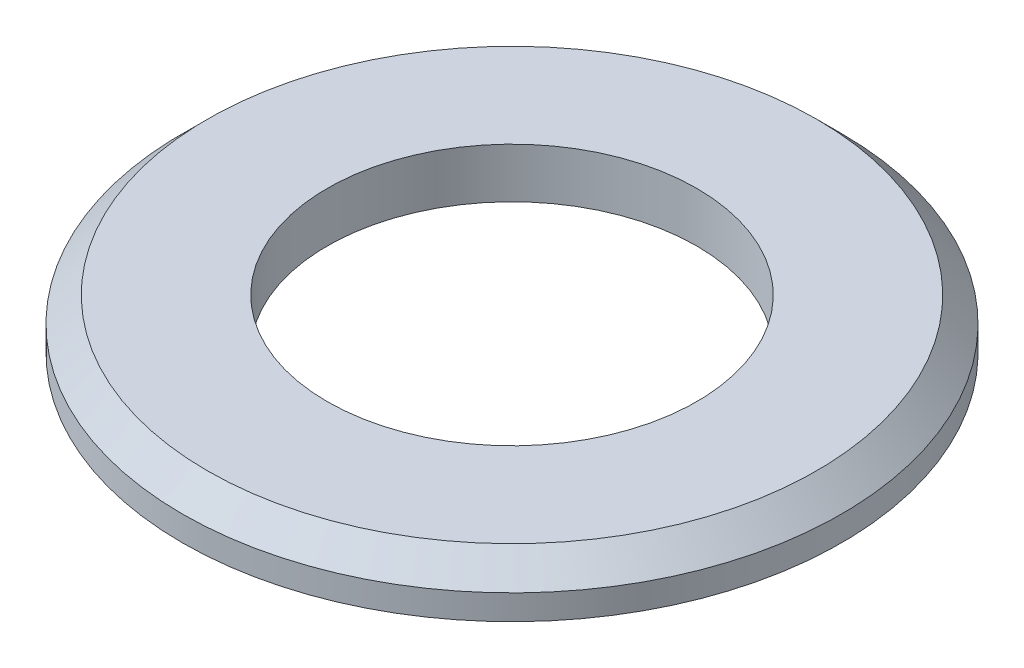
from build123d import *

# Parameters (mm, degrees)
SKETCH1_R      = 33
SKETCH1_R_2    = 18.5
EXTRUDE1_DEPTH = 5
CHAMFER1_SIZE  = 2.5


with BuildPart() as part:
    # Sketch1 → Extrude1 (new body)
    with BuildSketch(Plane(origin=(0, 0, 0), x_dir=(1, 0, 0), z_dir=(0, 1, 0))):
        with Locations(Location((0, 0, 0), (0, 0, 270))):
            Circle(SKETCH1_R)
        with Locations(Location((0, 0, 0), (0, 0, 270))):
            Circle(SKETCH1_R_2, mode=Mode.SUBTRACT)
    extrude(amount=EXTRUDE1_DEPTH)

    # Chamfer1
    chamfer1_edges = [part.edges().sort_by_distance(p)[0] for p in [
        (0, 5, -33),
    ]]
    chamfer(chamfer1_edges, length=CHAMFER1_SIZE)


solid = part.part
